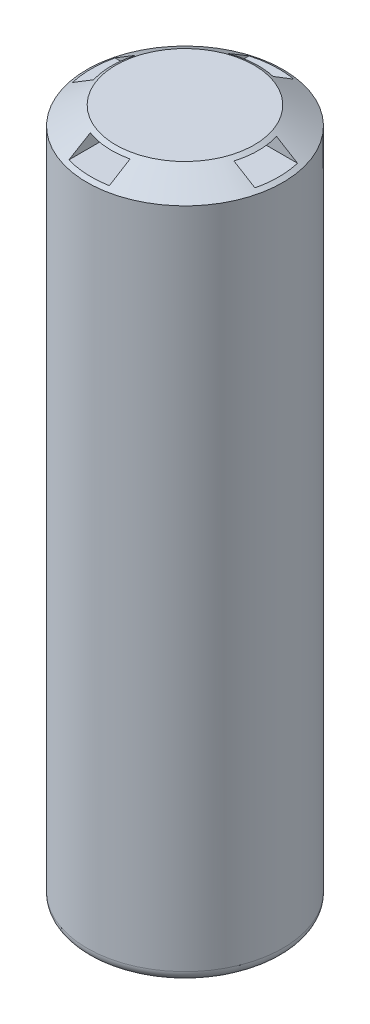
from build123d import *

# Parameters (mm, degrees)
SKETCH1_R               = 9.2
BOSS_EXTRUDE1_DEPTH     = 65
FILLET1_R               = 1
CUT_EXTRUDE1_DEPTH      = 20
CUT_EXTRUDE1_DEPTH_BACK = 20
SKETCH3_W               = 4
SKETCH3_H               = 1.2
CUT_EXTRUDE2_DEPTH      = 20
CUT_EXTRUDE2_DEPTH_BACK = 20
SKETCH4_W               = 4
SKETCH4_H               = 1.2


with BuildPart() as part:
    # Sketch1 → Boss-Extrude1 (new body)
    with BuildSketch(Plane(origin=(0, 0, 0), x_dir=(1, 0, 0), z_dir=(0, 1, 0))):
        with Locations(Location((0, 0, 0), (0, 0, 270))):
            Circle(SKETCH1_R)
    extrude(amount=BOSS_EXTRUDE1_DEPTH)

    # Fillet1
    fillet1_edges = [part.edges().sort_by_distance(p)[0] for p in [
        (0, 0, -9.2),
    ]]
    fillet(fillet1_edges, radius=FILLET1_R)

    # Sketch2 → Cut-Revolve2 (revolve, cut)
    with BuildSketch(Plane(origin=(0, 0, 0), x_dir=(0, 0, -1), z_dir=(1, 0, 0))):
        Polygon((9.2, 63.3), (6.5, 65), (9.2, 65), align=None)
    revolve(axis=Axis((0, -3.389376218, 0), (0, 1, 0)), mode=Mode.SUBTRACT)

    # Sketch3 → Cut-Extrude1 (cut, two sides: drawn at the far end of the back side and taken through both)
    with BuildSketch(Plane(origin=(0, 0, 0), x_dir=(0, 0, -1), z_dir=(1, 0, 0)).offset(-CUT_EXTRUDE1_DEPTH_BACK)):
        with Locations((0, 64.15)):
            Rectangle(SKETCH3_W, SKETCH3_H)
    extrude(amount=CUT_EXTRUDE1_DEPTH + CUT_EXTRUDE1_DEPTH_BACK, mode=Mode.SUBTRACT)

    # Sketch4 → Cut-Extrude2 (cut, two sides: drawn at the far end of the back side and taken through both)
    with BuildSketch(Plane.XY.offset(-CUT_EXTRUDE2_DEPTH_BACK)):
        with Locations((-0.442612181, 64.15)):
            Rectangle(SKETCH4_W, SKETCH4_H)
    extrude(amount=CUT_EXTRUDE2_DEPTH + CUT_EXTRUDE2_DEPTH_BACK, mode=Mode.SUBTRACT)


solid = part.part
